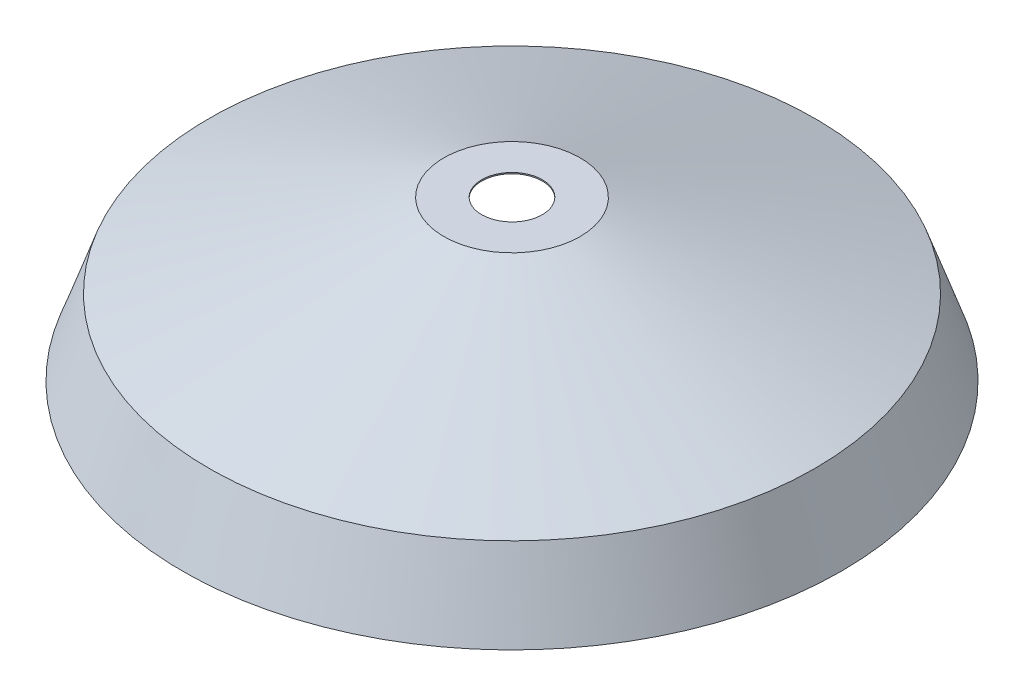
ISO-10303-21;
HEADER;
FILE_DESCRIPTION(('STEP AP214'),'2;1');
FILE_NAME('part.step','',(''),(''),'','','');
FILE_SCHEMA(('AUTOMOTIVE_DESIGN { 1 0 10303 214 1 1 1 1 }'));
ENDSEC;
DATA;
#1=APPLICATION_CONTEXT('core data for automotive mechanical design processes');
#2=APPLICATION_PROTOCOL_DEFINITION('international standard','automotive_design',2000,#1);
#3=PRODUCT_CONTEXT('',#1,'mechanical');
#4=PRODUCT('Part','Part','',(#3));
#5=PRODUCT_RELATED_PRODUCT_CATEGORY('part','',(#4));
#6=PRODUCT_DEFINITION_FORMATION('','',#4);
#7=PRODUCT_DEFINITION_CONTEXT('part definition',#1,'design');
#8=PRODUCT_DEFINITION('design','',#6,#7);
#9=PRODUCT_DEFINITION_SHAPE('','',#8);
#10=(LENGTH_UNIT() NAMED_UNIT(*) SI_UNIT(.MILLI.,.METRE.));
#11=(NAMED_UNIT(*) PLANE_ANGLE_UNIT() SI_UNIT($,.RADIAN.));
#12=(NAMED_UNIT(*) SI_UNIT($,.STERADIAN.) SOLID_ANGLE_UNIT());
#13=UNCERTAINTY_MEASURE_WITH_UNIT(LENGTH_MEASURE(1.E-05),#10,'distance_accuracy_value','');
#14=(GEOMETRIC_REPRESENTATION_CONTEXT(3) GLOBAL_UNCERTAINTY_ASSIGNED_CONTEXT((#13)) GLOBAL_UNIT_ASSIGNED_CONTEXT((#10,
#11,#12)) REPRESENTATION_CONTEXT('',''));
#15=CARTESIAN_POINT('',(0.,0.,0.));
#16=DIRECTION('',(0.,0.,1.));
#17=DIRECTION('',(1.,0.,0.));
#18=AXIS2_PLACEMENT_3D('',#15,#16,#17);
#19=CARTESIAN_POINT('',(-9.43689570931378E-13,-52.5000000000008,0.));
#20=DIRECTION('',(0.,-1.,0.));
#21=DIRECTION('',(1.,0.,0.));
#22=AXIS2_PLACEMENT_3D('',#19,#20,#21);
#23=CONICAL_SURFACE('',#22,217.5,0.336674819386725);
#24=CARTESIAN_POINT('',(-1.185731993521E-12,-2.50000000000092,0.));
#25=DIRECTION('',(0.,1.,0.));
#26=DIRECTION('',(-1.,0.,0.));
#27=AXIS2_PLACEMENT_3D('',#24,#25,#26);
#28=CIRCLE('',#27,200.);
#29=CARTESIAN_POINT('',(199.999999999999,-2.49999999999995,0.));
#30=VERTEX_POINT('',#29);
#31=EDGE_CURVE('E64',#30,#30,#28,.T.);
#32=ORIENTED_EDGE('',*,*,#31,.F.);
#33=EDGE_LOOP('',(#32));
#34=FACE_BOUND('',#33,.T.);
#35=CARTESIAN_POINT('',(-9.43689570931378E-13,-52.5000000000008,0.));
#36=DIRECTION('',(0.,1.,0.));
#37=DIRECTION('',(-1.,0.,0.));
#38=AXIS2_PLACEMENT_3D('',#35,#36,#37);
#39=CIRCLE('',#38,217.5);
#40=CARTESIAN_POINT('',(-217.500000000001,-52.5000000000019,0.));
#41=VERTEX_POINT('',#40);
#42=EDGE_CURVE('E10',#41,#41,#39,.T.);
#43=ORIENTED_EDGE('',*,*,#42,.T.);
#44=EDGE_LOOP('',(#43));
#45=FACE_BOUND('',#44,.T.);
#46=ADVANCED_FACE('F37',(#34,#45),#23,.T.);
#47=CARTESIAN_POINT('',(216.652415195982,-52.5,0.));
#48=DIRECTION('',(0.,1.,0.));
#49=DIRECTION('',(-1.,0.,0.));
#50=AXIS2_PLACEMENT_3D('',#47,#48,#49);
#51=PLANE('',#50);
#52=ORIENTED_EDGE('',*,*,#42,.F.);
#53=EDGE_LOOP('',(#52));
#54=FACE_BOUND('',#53,.T.);
#55=CARTESIAN_POINT('',(-9.43689570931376E-13,-52.5000000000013,0.));
#56=DIRECTION('',(0.,1.,0.));
#57=DIRECTION('',(-1.,0.,0.));
#58=AXIS2_PLACEMENT_3D('',#55,#56,#57);
#59=CIRCLE('',#58,216.652415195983);
#60=CARTESIAN_POINT('',(-216.652415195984,-52.5000000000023,0.));
#61=VERTEX_POINT('',#60);
#62=EDGE_CURVE('E44',#61,#61,#59,.T.);
#63=ORIENTED_EDGE('',*,*,#62,.T.);
#64=EDGE_LOOP('',(#63));
#65=FACE_BOUND('',#64,.T.);
#66=ADVANCED_FACE('F93',(#54,#65),#51,.F.);
#67=CARTESIAN_POINT('',(-9.43689570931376E-13,-52.5000000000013,0.));
#68=DIRECTION('',(0.,-1.,0.));
#69=DIRECTION('',(1.,0.,0.));
#70=AXIS2_PLACEMENT_3D('',#67,#68,#69);
#71=CONICAL_SURFACE('',#70,216.652415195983,0.336674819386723);
#72=CARTESIAN_POINT('',(-1.1827023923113E-12,-3.12584095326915,0.));
#73=DIRECTION('',(0.,1.,0.));
#74=DIRECTION('',(-1.,0.,0.));
#75=AXIS2_PLACEMENT_3D('',#72,#73,#74);
#76=CIRCLE('',#75,199.371459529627);
#77=CARTESIAN_POINT('',(199.371459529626,-3.12584095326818,0.));
#78=VERTEX_POINT('',#77);
#79=EDGE_CURVE('E49',#78,#78,#76,.T.);
#80=ORIENTED_EDGE('',*,*,#79,.T.);
#81=EDGE_LOOP('',(#80));
#82=FACE_BOUND('',#81,.T.);
#83=ORIENTED_EDGE('',*,*,#62,.F.);
#84=EDGE_LOOP('',(#83));
#85=FACE_BOUND('',#84,.T.);
#86=ADVANCED_FACE('F97',(#82,#85),#71,.F.);
#87=CARTESIAN_POINT('',(-1.1827023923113E-12,-3.12584095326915,0.));
#88=DIRECTION('',(0.,-1.,0.));
#89=DIRECTION('',(1.,0.,0.));
#90=AXIS2_PLACEMENT_3D('',#87,#88,#89);
#91=CONICAL_SURFACE('',#90,199.371459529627,1.22981737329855);
#92=CARTESIAN_POINT('',(-1.44810597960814E-12,51.6999999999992,0.));
#93=DIRECTION('',(0.,1.,0.));
#94=DIRECTION('',(-1.,0.,0.));
#95=AXIS2_PLACEMENT_3D('',#92,#93,#94);
#96=CIRCLE('',#95,44.8622713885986);
#97=CARTESIAN_POINT('',(44.8622713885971,51.6999999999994,0.));
#98=VERTEX_POINT('',#97);
#99=EDGE_CURVE('E54',#98,#98,#96,.T.);
#100=CARTESIAN_POINT('',(44.8622713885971,51.6999999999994,0.));
#101=CARTESIAN_POINT('',(46.4717420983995,51.1288974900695,0.));
#102=CARTESIAN_POINT('',(48.0812128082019,50.5577949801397,0.));
#103=CARTESIAN_POINT('',(51.3001542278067,49.4155899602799,0.));
#104=CARTESIAN_POINT('',(52.9096249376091,48.8444874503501,0.));
#105=CARTESIAN_POINT('',(56.1285663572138,47.7022824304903,0.));
#106=CARTESIAN_POINT('',(57.7380370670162,47.1311799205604,0.));
#107=CARTESIAN_POINT('',(60.956978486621,45.9889749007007,0.));
#108=CARTESIAN_POINT('',(62.5664491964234,45.4178723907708,0.));
#109=CARTESIAN_POINT('',(65.7853906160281,44.2756673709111,0.));
#110=CARTESIAN_POINT('',(67.3948613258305,43.7045648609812,0.));
#111=CARTESIAN_POINT('',(70.6138027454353,42.5623598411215,0.));
#112=CARTESIAN_POINT('',(72.2232734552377,41.9912573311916,0.));
#113=CARTESIAN_POINT('',(75.4422148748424,40.8490523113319,0.));
#114=CARTESIAN_POINT('',(77.0516855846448,40.277949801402,0.));
#115=CARTESIAN_POINT('',(80.2706270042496,39.1357447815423,0.));
#116=CARTESIAN_POINT('',(81.880097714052,38.5646422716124,0.));
#117=CARTESIAN_POINT('',(85.0990391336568,37.4224372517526,0.));
#118=CARTESIAN_POINT('',(86.7085098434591,36.8513347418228,0.));
#119=CARTESIAN_POINT('',(89.9274512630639,35.709129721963,0.));
#120=CARTESIAN_POINT('',(91.5369219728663,35.1380272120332,0.));
#121=CARTESIAN_POINT('',(94.7558633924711,33.9958221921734,0.));
#122=CARTESIAN_POINT('',(96.3653341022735,33.4247196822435,0.));
#123=CARTESIAN_POINT('',(99.5842755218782,32.2825146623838,0.));
#124=CARTESIAN_POINT('',(101.193746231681,31.7114121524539,0.));
#125=CARTESIAN_POINT('',(104.412687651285,30.5692071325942,0.));
#126=CARTESIAN_POINT('',(106.022158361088,29.9981046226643,0.));
#127=CARTESIAN_POINT('',(109.241099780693,28.8558996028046,0.));
#128=CARTESIAN_POINT('',(110.850570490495,28.2847970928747,0.));
#129=CARTESIAN_POINT('',(114.0695119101,27.142592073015,0.));
#130=CARTESIAN_POINT('',(115.678982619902,26.5714895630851,0.));
#131=CARTESIAN_POINT('',(118.897924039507,25.4292845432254,0.));
#132=CARTESIAN_POINT('',(120.507394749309,24.8581820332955,0.));
#133=CARTESIAN_POINT('',(123.726336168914,23.7159770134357,0.));
#134=CARTESIAN_POINT('',(125.335806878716,23.1448745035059,0.));
#135=CARTESIAN_POINT('',(128.554748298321,22.0026694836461,0.));
#136=CARTESIAN_POINT('',(130.164219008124,21.4315669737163,0.));
#137=CARTESIAN_POINT('',(133.383160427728,20.2893619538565,0.));
#138=CARTESIAN_POINT('',(134.992631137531,19.7182594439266,0.));
#139=CARTESIAN_POINT('',(138.211572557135,18.5760544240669,0.));
#140=CARTESIAN_POINT('',(139.821043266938,18.004951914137,0.));
#141=CARTESIAN_POINT('',(143.039984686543,16.8627468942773,0.));
#142=CARTESIAN_POINT('',(144.649455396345,16.2916443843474,0.));
#143=CARTESIAN_POINT('',(147.86839681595,15.1494393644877,0.));
#144=CARTESIAN_POINT('',(149.477867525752,14.5783368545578,0.));
#145=CARTESIAN_POINT('',(152.696808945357,13.4361318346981,0.));
#146=CARTESIAN_POINT('',(154.306279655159,12.8650293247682,0.));
#147=CARTESIAN_POINT('',(157.525221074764,11.7228243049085,0.));
#148=CARTESIAN_POINT('',(159.134691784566,11.1517217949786,0.));
#149=CARTESIAN_POINT('',(162.353633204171,10.0095167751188,0.));
#150=CARTESIAN_POINT('',(163.963103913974,9.43841426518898,0.));
#151=CARTESIAN_POINT('',(167.182045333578,8.29620924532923,0.));
#152=CARTESIAN_POINT('',(168.791516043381,7.72510673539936,0.));
#153=CARTESIAN_POINT('',(172.010457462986,6.58290171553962,0.));
#154=CARTESIAN_POINT('',(173.619928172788,6.01179920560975,0.));
#155=CARTESIAN_POINT('',(176.838869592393,4.86959418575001,0.));
#156=CARTESIAN_POINT('',(178.448340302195,4.29849167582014,0.));
#157=CARTESIAN_POINT('',(181.6672817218,3.1562866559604,0.));
#158=CARTESIAN_POINT('',(183.276752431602,2.58518414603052,0.));
#159=CARTESIAN_POINT('',(186.495693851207,1.44297912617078,0.));
#160=CARTESIAN_POINT('',(188.105164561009,0.871876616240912,0.));
#161=CARTESIAN_POINT('',(191.324105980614,-0.27032840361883,0.));
#162=CARTESIAN_POINT('',(192.933576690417,-0.841430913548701,0.));
#163=CARTESIAN_POINT('',(196.152518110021,-1.98363593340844,0.));
#164=CARTESIAN_POINT('',(197.761988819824,-2.55473844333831,0.));
#165=CARTESIAN_POINT('',(199.371459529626,-3.12584095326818,0.));
#166=B_SPLINE_CURVE_WITH_KNOTS('',3,(#100,#101,#102,#103,#104,#105,#106,#107,#108,#109,#110,
#111,#112,#113,#114,#115,#116,#117,#118,#119,#120,#121,#122,#123,#124,#125,#126,#127,#128,#129,
#130,#131,#132,#133,#134,#135,#136,#137,#138,#139,#140,#141,#142,#143,#144,#145,#146,#147,#148,
#149,#150,#151,#152,#153,#154,#155,#156,#157,#158,#159,#160,#161,#162,#163,#164,#165),
.UNSPECIFIED.,.F.,.F.,(4,2,2,2,2,2,2,2,2,2,2,2,2,2,2,2,2,2,2,2,2,2,2,2,2,2,2,2,2,2,2,2,4),(0.,
5.12337646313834,10.2467529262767,15.370129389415,20.4935058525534,25.6168823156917,
30.74025877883,35.8636352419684,40.9870117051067,46.110388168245,51.2337646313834,
56.3571410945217,61.4805175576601,66.6038940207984,71.7272704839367,76.8506469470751,
81.9740234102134,87.0973998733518,92.2207763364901,97.3441527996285,102.467529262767,
107.590905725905,112.714282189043,117.837658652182,122.96103511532,128.084411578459,
133.207788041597,138.331164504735,143.454540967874,148.577917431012,153.70129389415,
158.824670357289,163.948046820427),.UNSPECIFIED.);
#167=EDGE_CURVE('BSEAM102',#98,#78,#166,.T.);
#168=ORIENTED_EDGE('',*,*,#99,.T.);
#169=ORIENTED_EDGE('',*,*,#79,.F.);
#170=ORIENTED_EDGE('',*,*,#167,.T.);
#171=ORIENTED_EDGE('',*,*,#167,.F.);
#172=EDGE_LOOP('',(#168,#170,#169,#171));
#173=FACE_BOUND('',#172,.T.);
#174=ADVANCED_FACE('F102',(#173),#91,.F.);
#175=CARTESIAN_POINT('',(44.8622713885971,51.6999999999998,0.));
#176=DIRECTION('',(0.,-1.,0.));
#177=DIRECTION('',(1.,0.,0.));
#178=AXIS2_PLACEMENT_3D('',#175,#176,#177);
#179=PLANE('',#178);
#180=CARTESIAN_POINT('',(-1.44810597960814E-12,51.6999999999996,0.));
#181=DIRECTION('',(0.,-1.,0.));
#182=DIRECTION('',(1.,0.,0.));
#183=AXIS2_PLACEMENT_3D('',#180,#181,#182);
#184=CIRCLE('',#183,20.);
#185=CARTESIAN_POINT('',(19.9999999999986,51.6999999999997,0.));
#186=VERTEX_POINT('',#185);
#187=EDGE_CURVE('E68',#186,#186,#184,.T.);
#188=ORIENTED_EDGE('',*,*,#187,.F.);
#189=EDGE_LOOP('',(#188));
#190=FACE_BOUND('',#189,.T.);
#191=ORIENTED_EDGE('',*,*,#99,.F.);
#192=EDGE_LOOP('',(#191));
#193=FACE_BOUND('',#192,.T.);
#194=ADVANCED_FACE('F83',(#190,#193),#179,.T.);
#195=CARTESIAN_POINT('',(-1.45283846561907E-12,52.5000000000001,0.));
#196=DIRECTION('',(0.,1.,0.));
#197=DIRECTION('',(-1.,0.,0.));
#198=AXIS2_PLACEMENT_3D('',#195,#196,#197);
#199=PLANE('',#198);
#200=CARTESIAN_POINT('',(-1.45197865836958E-12,52.5000000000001,0.));
#201=DIRECTION('',(0.,1.,0.));
#202=DIRECTION('',(-1.,0.,0.));
#203=AXIS2_PLACEMENT_3D('',#200,#201,#202);
#204=CIRCLE('',#203,20.);
#205=CARTESIAN_POINT('',(-20.0000000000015,52.5,0.));
#206=VERTEX_POINT('',#205);
#207=EDGE_CURVE('E72',#206,#206,#204,.T.);
#208=ORIENTED_EDGE('',*,*,#207,.F.);
#209=EDGE_LOOP('',(#208));
#210=FACE_BOUND('',#209,.T.);
#211=CARTESIAN_POINT('',(-1.45197865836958E-12,52.5,0.));
#212=DIRECTION('',(0.,1.,0.));
#213=DIRECTION('',(-1.,0.,0.));
#214=AXIS2_PLACEMENT_3D('',#211,#212,#213);
#215=CIRCLE('',#214,45.0000000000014);
#216=CARTESIAN_POINT('',(44.9999999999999,52.5000000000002,0.));
#217=VERTEX_POINT('',#216);
#218=EDGE_CURVE('E60',#217,#217,#215,.T.);
#219=ORIENTED_EDGE('',*,*,#218,.T.);
#220=EDGE_LOOP('',(#219));
#221=FACE_BOUND('',#220,.T.);
#222=ADVANCED_FACE('F79',(#210,#221),#199,.T.);
#223=CARTESIAN_POINT('',(-1.185731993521E-12,-2.50000000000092,0.));
#224=DIRECTION('',(0.,-1.,0.));
#225=DIRECTION('',(1.,0.,0.));
#226=AXIS2_PLACEMENT_3D('',#223,#224,#225);
#227=CONICAL_SURFACE('',#226,200.,1.22981737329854);
#228=CARTESIAN_POINT('',(44.9999999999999,52.5000000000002,0.));
#229=CARTESIAN_POINT('',(46.6145833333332,51.9270833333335,0.));
#230=CARTESIAN_POINT('',(48.2291666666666,51.3541666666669,0.));
#231=CARTESIAN_POINT('',(51.4583333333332,50.2083333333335,0.));
#232=CARTESIAN_POINT('',(53.0729166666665,49.6354166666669,0.));
#233=CARTESIAN_POINT('',(56.3020833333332,48.4895833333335,0.));
#234=CARTESIAN_POINT('',(57.9166666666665,47.9166666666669,0.));
#235=CARTESIAN_POINT('',(61.1458333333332,46.7708333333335,0.));
#236=CARTESIAN_POINT('',(62.7604166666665,46.1979166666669,0.));
#237=CARTESIAN_POINT('',(65.9895833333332,45.0520833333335,0.));
#238=CARTESIAN_POINT('',(67.6041666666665,44.4791666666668,0.));
#239=CARTESIAN_POINT('',(70.8333333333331,43.3333333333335,0.));
#240=CARTESIAN_POINT('',(72.4479166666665,42.7604166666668,0.));
#241=CARTESIAN_POINT('',(75.6770833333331,41.6145833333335,0.));
#242=CARTESIAN_POINT('',(77.2916666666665,41.0416666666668,0.));
#243=CARTESIAN_POINT('',(80.5208333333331,39.8958333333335,0.));
#244=CARTESIAN_POINT('',(82.1354166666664,39.3229166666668,0.));
#245=CARTESIAN_POINT('',(85.3645833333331,38.1770833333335,0.));
#246=CARTESIAN_POINT('',(86.9791666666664,37.6041666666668,0.));
#247=CARTESIAN_POINT('',(90.2083333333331,36.4583333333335,0.));
#248=CARTESIAN_POINT('',(91.8229166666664,35.8854166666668,0.));
#249=CARTESIAN_POINT('',(95.052083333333,34.7395833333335,0.));
#250=CARTESIAN_POINT('',(96.6666666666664,34.1666666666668,0.));
#251=CARTESIAN_POINT('',(99.895833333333,33.0208333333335,0.));
#252=CARTESIAN_POINT('',(101.510416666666,32.4479166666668,0.));
#253=CARTESIAN_POINT('',(104.739583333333,31.3020833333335,0.));
#254=CARTESIAN_POINT('',(106.354166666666,30.7291666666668,0.));
#255=CARTESIAN_POINT('',(109.583333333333,29.5833333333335,0.));
#256=CARTESIAN_POINT('',(111.197916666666,29.0104166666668,0.));
#257=CARTESIAN_POINT('',(114.427083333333,27.8645833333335,0.));
#258=CARTESIAN_POINT('',(116.041666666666,27.2916666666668,0.));
#259=CARTESIAN_POINT('',(119.270833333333,26.1458333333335,0.));
#260=CARTESIAN_POINT('',(120.885416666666,25.5729166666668,0.));
#261=CARTESIAN_POINT('',(124.114583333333,24.4270833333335,0.));
#262=CARTESIAN_POINT('',(125.729166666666,23.8541666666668,0.));
#263=CARTESIAN_POINT('',(128.958333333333,22.7083333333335,0.));
#264=CARTESIAN_POINT('',(130.572916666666,22.1354166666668,0.));
#265=CARTESIAN_POINT('',(133.802083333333,20.9895833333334,0.));
#266=CARTESIAN_POINT('',(135.416666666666,20.4166666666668,0.));
#267=CARTESIAN_POINT('',(138.645833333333,19.2708333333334,0.));
#268=CARTESIAN_POINT('',(140.260416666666,18.6979166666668,0.));
#269=CARTESIAN_POINT('',(143.489583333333,17.5520833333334,0.));
#270=CARTESIAN_POINT('',(145.104166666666,16.9791666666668,0.));
#271=CARTESIAN_POINT('',(148.333333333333,15.8333333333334,0.));
#272=CARTESIAN_POINT('',(149.947916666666,15.2604166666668,0.));
#273=CARTESIAN_POINT('',(153.177083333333,14.1145833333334,0.));
#274=CARTESIAN_POINT('',(154.791666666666,13.5416666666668,0.));
#275=CARTESIAN_POINT('',(158.020833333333,12.3958333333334,0.));
#276=CARTESIAN_POINT('',(159.635416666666,11.8229166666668,0.));
#277=CARTESIAN_POINT('',(162.864583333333,10.6770833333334,0.));
#278=CARTESIAN_POINT('',(164.479166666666,10.1041666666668,0.));
#279=CARTESIAN_POINT('',(167.708333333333,8.95833333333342,0.));
#280=CARTESIAN_POINT('',(169.322916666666,8.38541666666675,0.));
#281=CARTESIAN_POINT('',(172.552083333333,7.23958333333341,0.));
#282=CARTESIAN_POINT('',(174.166666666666,6.66666666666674,0.));
#283=CARTESIAN_POINT('',(177.395833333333,5.52083333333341,0.));
#284=CARTESIAN_POINT('',(179.010416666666,4.94791666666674,0.));
#285=CARTESIAN_POINT('',(182.239583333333,3.8020833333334,0.));
#286=CARTESIAN_POINT('',(183.854166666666,3.22916666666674,0.));
#287=CARTESIAN_POINT('',(187.083333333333,2.0833333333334,0.));
#288=CARTESIAN_POINT('',(188.697916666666,1.51041666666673,0.));
#289=CARTESIAN_POINT('',(191.927083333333,0.364583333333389,0.));
#290=CARTESIAN_POINT('',(193.541666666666,-0.208333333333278,0.));
#291=CARTESIAN_POINT('',(196.770833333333,-1.35416666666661,0.));
#292=CARTESIAN_POINT('',(198.385416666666,-1.92708333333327,0.));
#293=CARTESIAN_POINT('',(199.999999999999,-2.49999999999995,0.));
#294=B_SPLINE_CURVE_WITH_KNOTS('',3,(#228,#229,#230,#231,#232,#233,#234,#235,#236,#237,#238,
#239,#240,#241,#242,#243,#244,#245,#246,#247,#248,#249,#250,#251,#252,#253,#254,#255,#256,#257,
#258,#259,#260,#261,#262,#263,#264,#265,#266,#267,#268,#269,#270,#271,#272,#273,#274,#275,#276,
#277,#278,#279,#280,#281,#282,#283,#284,#285,#286,#287,#288,#289,#290,#291,#292,#293),
.UNSPECIFIED.,.F.,.F.,(4,2,2,2,2,2,2,2,2,2,2,2,2,2,2,2,2,2,2,2,2,2,2,2,2,2,2,2,2,2,2,2,4),(0.,
5.13965131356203,10.2793026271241,15.4189539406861,20.5586052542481,25.6982565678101,
30.8379078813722,35.9775591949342,41.1172105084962,46.2568618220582,51.3965131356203,
56.5361644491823,61.6758157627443,66.8154670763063,71.9551183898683,77.0947697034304,
82.2344210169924,87.3740723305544,92.5137236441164,97.6533749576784,102.79302627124,
107.932677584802,113.072328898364,118.211980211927,123.351631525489,128.491282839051,
133.630934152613,138.770585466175,143.910236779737,149.049888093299,154.189539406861,
159.329190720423,164.468842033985),.UNSPECIFIED.);
#295=EDGE_CURVE('BSEAM82',#217,#30,#294,.T.);
#296=ORIENTED_EDGE('',*,*,#218,.F.);
#297=ORIENTED_EDGE('',*,*,#31,.T.);
#298=ORIENTED_EDGE('',*,*,#295,.T.);
#299=ORIENTED_EDGE('',*,*,#295,.F.);
#300=EDGE_LOOP('',(#296,#298,#297,#299));
#301=FACE_BOUND('',#300,.T.);
#302=ADVANCED_FACE('F82',(#301),#227,.T.);
#303=CARTESIAN_POINT('',(-1.40357017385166E-12,42.5000000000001,0.));
#304=DIRECTION('',(0.,1.,0.));
#305=DIRECTION('',(-1.,0.,0.));
#306=AXIS2_PLACEMENT_3D('',#303,#304,#305);
#307=CYLINDRICAL_SURFACE('',#306,20.);
#308=ORIENTED_EDGE('',*,*,#187,.T.);
#309=EDGE_LOOP('',(#308));
#310=FACE_BOUND('',#309,.T.);
#311=ORIENTED_EDGE('',*,*,#207,.T.);
#312=EDGE_LOOP('',(#311));
#313=FACE_BOUND('',#312,.T.);
#314=ADVANCED_FACE('F77',(#310,#313),#307,.F.);
#315=CLOSED_SHELL('',(#46,#66,#86,#174,#194,#222,#302,#314));
#316=MANIFOLD_SOLID_BREP('B2',#315);
#317=ADVANCED_BREP_SHAPE_REPRESENTATION('',(#18,#316),#14);
#318=SHAPE_DEFINITION_REPRESENTATION(#9,#317);
ENDSEC;
END-ISO-10303-21;
